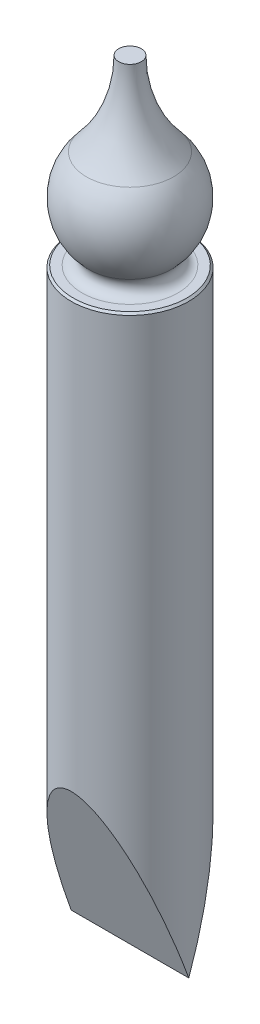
ISO-10303-21;
HEADER;
FILE_DESCRIPTION(('STEP AP214'),'2;1');
FILE_NAME('part.step','',(''),(''),'','','');
FILE_SCHEMA(('AUTOMOTIVE_DESIGN { 1 0 10303 214 1 1 1 1 }'));
ENDSEC;
DATA;
#1=APPLICATION_CONTEXT('core data for automotive mechanical design processes');
#2=APPLICATION_PROTOCOL_DEFINITION('international standard','automotive_design',2000,#1);
#3=PRODUCT_CONTEXT('',#1,'mechanical');
#4=PRODUCT('Part','Part','',(#3));
#5=PRODUCT_RELATED_PRODUCT_CATEGORY('part','',(#4));
#6=PRODUCT_DEFINITION_FORMATION('','',#4);
#7=PRODUCT_DEFINITION_CONTEXT('part definition',#1,'design');
#8=PRODUCT_DEFINITION('design','',#6,#7);
#9=PRODUCT_DEFINITION_SHAPE('','',#8);
#10=(LENGTH_UNIT() NAMED_UNIT(*) SI_UNIT(.MILLI.,.METRE.));
#11=(NAMED_UNIT(*) PLANE_ANGLE_UNIT() SI_UNIT($,.RADIAN.));
#12=(NAMED_UNIT(*) SI_UNIT($,.STERADIAN.) SOLID_ANGLE_UNIT());
#13=UNCERTAINTY_MEASURE_WITH_UNIT(LENGTH_MEASURE(1.E-05),#10,'distance_accuracy_value','');
#14=(GEOMETRIC_REPRESENTATION_CONTEXT(3) GLOBAL_UNCERTAINTY_ASSIGNED_CONTEXT((#13)) GLOBAL_UNIT_ASSIGNED_CONTEXT((#10,
#11,#12)) REPRESENTATION_CONTEXT('',''));
#15=CARTESIAN_POINT('',(0.,0.,0.));
#16=DIRECTION('',(0.,0.,1.));
#17=DIRECTION('',(1.,0.,0.));
#18=AXIS2_PLACEMENT_3D('',#15,#16,#17);
#19=CARTESIAN_POINT('',(-0.575,39.2822667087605,0.));
#20=DIRECTION('',(0.,-1.,0.));
#21=DIRECTION('',(0.,0.,-1.));
#22=AXIS2_PLACEMENT_3D('',#19,#20,#21);
#23=PLANE('',#22);
#24=CARTESIAN_POINT('',(0.,39.2822667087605,0.));
#25=DIRECTION('',(0.,-1.,0.));
#26=DIRECTION('',(0.,0.,-1.));
#27=AXIS2_PLACEMENT_3D('',#24,#25,#26);
#28=CIRCLE('',#27,0.575);
#29=CARTESIAN_POINT('',(0.,39.2822667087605,-0.575));
#30=VERTEX_POINT('',#29);
#31=EDGE_CURVE('E69',#30,#30,#28,.T.);
#32=ORIENTED_EDGE('',*,*,#31,.F.);
#33=EDGE_LOOP('',(#32));
#34=FACE_BOUND('',#33,.T.);
#35=ADVANCED_FACE('F31',(#34),#23,.F.);
#36=CARTESIAN_POINT('',(0.,39.2822667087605,0.));
#37=DIRECTION('',(0.,-1.,0.));
#38=DIRECTION('',(0.,0.,-1.));
#39=AXIS2_PLACEMENT_3D('',#36,#37,#38);
#40=TOROIDAL_SURFACE('',#39,6.925,6.35);
#41=CARTESIAN_POINT('',(0.,35.0157005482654,0.));
#42=DIRECTION('',(0.,-1.,0.));
#43=DIRECTION('',(0.,0.,-1.));
#44=AXIS2_PLACEMENT_3D('',#41,#42,#43);
#45=CIRCLE('',#44,2.22192513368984);
#46=CARTESIAN_POINT('',(-2.22192513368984,35.0157005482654,0.));
#47=VERTEX_POINT('',#46);
#48=EDGE_CURVE('E66',#47,#47,#45,.T.);
#49=ORIENTED_EDGE('',*,*,#48,.F.);
#50=EDGE_LOOP('',(#49));
#51=FACE_BOUND('',#50,.T.);
#52=ORIENTED_EDGE('',*,*,#31,.T.);
#53=EDGE_LOOP('',(#52));
#54=FACE_BOUND('',#53,.T.);
#55=ADVANCED_FACE('F83',(#51,#54),#40,.F.);
#56=CARTESIAN_POINT('',(0.,33.,0.));
#57=DIRECTION('',(0.,-1.,0.));
#58=DIRECTION('',(-1.,0.,0.));
#59=AXIS2_PLACEMENT_3D('',#56,#57,#58);
#60=SPHERICAL_SURFACE('',#59,3.);
#61=CARTESIAN_POINT('',(0.,30.8571428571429,0.));
#62=DIRECTION('',(0.,-1.,0.));
#63=DIRECTION('',(0.,0.,-1.));
#64=AXIS2_PLACEMENT_3D('',#61,#62,#63);
#65=CIRCLE('',#64,2.09956263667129);
#66=CARTESIAN_POINT('',(-2.0995626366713,30.8571428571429,0.));
#67=VERTEX_POINT('',#66);
#68=EDGE_CURVE('E63',#67,#67,#65,.T.);
#69=CARTESIAN_POINT('',(-2.0995626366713,30.8571428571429,0.));
#70=CARTESIAN_POINT('',(-2.1337681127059,30.8906559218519,0.));
#71=CARTESIAN_POINT('',(-2.16716980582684,30.9249892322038,0.));
#72=CARTESIAN_POINT('',(-2.23229208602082,30.9952148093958,0.));
#73=CARTESIAN_POINT('',(-2.26401267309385,31.0311070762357,0.));
#74=CARTESIAN_POINT('',(-2.32569920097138,31.1043690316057,0.));
#75=CARTESIAN_POINT('',(-2.35566514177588,31.1417387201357,0.));
#76=CARTESIAN_POINT('',(-2.41377389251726,31.2178696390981,0.));
#77=CARTESIAN_POINT('',(-2.44191670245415,31.2566308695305,0.));
#78=CARTESIAN_POINT('',(-2.49631461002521,31.3354560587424,0.));
#79=CARTESIAN_POINT('',(-2.52256970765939,31.3755200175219,0.));
#80=CARTESIAN_POINT('',(-2.57313201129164,31.4568587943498,0.));
#81=CARTESIAN_POINT('',(-2.5974392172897,31.4981336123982,0.));
#82=CARTESIAN_POINT('',(-2.64405000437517,31.581799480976,0.));
#83=CARTESIAN_POINT('',(-2.66635358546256,31.6241905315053,0.));
#84=CARTESIAN_POINT('',(-2.70890598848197,31.7099916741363,0.));
#85=CARTESIAN_POINT('',(-2.72915481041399,31.753401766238,0.));
#86=CARTESIAN_POINT('',(-2.76755127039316,31.8411414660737,0.));
#87=CARTESIAN_POINT('',(-2.78569890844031,31.8854710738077,0.));
#88=CARTESIAN_POINT('',(-2.81985139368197,31.9749481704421,0.));
#89=CARTESIAN_POINT('',(-2.83585624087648,32.0200956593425,0.));
#90=CARTESIAN_POINT('',(-2.86568645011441,32.1111050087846,0.));
#91=CARTESIAN_POINT('',(-2.87951181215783,32.1569668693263,0.));
#92=CARTESIAN_POINT('',(-2.90495135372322,32.2492998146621,0.));
#93=CARTESIAN_POINT('',(-2.9165655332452,32.2957708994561,0.));
#94=CARTESIAN_POINT('',(-2.93755608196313,32.3892157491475,0.));
#95=CARTESIAN_POINT('',(-2.94693245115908,32.4361895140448,0.));
#96=CARTESIAN_POINT('',(-2.96342588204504,32.5305320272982,0.));
#97=CARTESIAN_POINT('',(-2.97054294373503,32.5779007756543,0.));
#98=CARTESIAN_POINT('',(-2.98250144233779,32.6729246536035,0.));
#99=CARTESIAN_POINT('',(-2.98734287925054,32.7205797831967,0.));
#100=CARTESIAN_POINT('',(-2.99473902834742,32.8160671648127,0.));
#101=CARTESIAN_POINT('',(-2.99729374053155,32.8638994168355,0.));
#102=CARTESIAN_POINT('',(-3.00011058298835,32.9596313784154,0.));
#103=CARTESIAN_POINT('',(-3.00037271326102,33.0075310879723,0.));
#104=CARTESIAN_POINT('',(-2.99860379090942,33.1032881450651,0.));
#105=CARTESIAN_POINT('',(-2.99657273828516,33.1511454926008,0.));
#106=CARTESIAN_POINT('',(-2.99022210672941,33.2467081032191,0.));
#107=CARTESIAN_POINT('',(-2.98590252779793,33.2944133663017,0.));
#108=CARTESIAN_POINT('',(-2.97498474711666,33.3895624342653,0.));
#109=CARTESIAN_POINT('',(-2.96838654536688,33.4370062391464,0.));
#110=CARTESIAN_POINT('',(-2.95292664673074,33.5315236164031,0.));
#111=CARTESIAN_POINT('',(-2.94406494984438,33.5785971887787,0.));
#112=CARTESIAN_POINT('',(-2.92409837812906,33.6722661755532,0.));
#113=CARTESIAN_POINT('',(-2.91299350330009,33.7188615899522,0.));
#114=CARTESIAN_POINT('',(-2.88856603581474,33.8114674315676,0.));
#115=CARTESIAN_POINT('',(-2.87524344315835,33.8574778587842,0.));
#116=CARTESIAN_POINT('',(-2.84641108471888,33.9488082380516,0.));
#117=CARTESIAN_POINT('',(-2.83090131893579,33.9941281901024,0.));
#118=CARTESIAN_POINT('',(-2.79773017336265,34.0839737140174,0.));
#119=CARTESIAN_POINT('',(-2.7800687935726,34.1284992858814,0.));
#120=CARTESIAN_POINT('',(-2.74263491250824,34.2166539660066,0.));
#121=CARTESIAN_POINT('',(-2.72286241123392,34.2602830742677,0.));
#122=CARTESIAN_POINT('',(-2.68125161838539,34.3465447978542,0.));
#123=CARTESIAN_POINT('',(-2.65941332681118,34.3891774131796,0.));
#124=CARTESIAN_POINT('',(-2.61372102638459,34.4733484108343,0.));
#125=CARTESIAN_POINT('',(-2.58986701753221,34.5148867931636,0.));
#126=CARTESIAN_POINT('',(-2.54019795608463,34.5967740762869,0.));
#127=CARTESIAN_POINT('',(-2.51438290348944,34.6371229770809,0.));
#128=CARTESIAN_POINT('',(-2.46085100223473,34.7165388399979,0.));
#129=CARTESIAN_POINT('',(-2.43313415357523,34.7556058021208,0.));
#130=CARTESIAN_POINT('',(-2.37586197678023,34.8323680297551,0.));
#131=CARTESIAN_POINT('',(-2.34630664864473,34.8700632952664,0.));
#132=CARTESIAN_POINT('',(-2.28542613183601,34.9439964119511,0.));
#133=CARTESIAN_POINT('',(-2.25410094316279,34.9802342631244,0.));
#134=CARTESIAN_POINT('',(-2.22192513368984,35.0157005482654,0.));
#135=B_SPLINE_CURVE_WITH_KNOTS('',3,(#69,#70,#71,#72,#73,#74,#75,#76,#77,#78,#79,#80,#81,#82,
#83,#84,#85,#86,#87,#88,#89,#90,#91,#92,#93,#94,#95,#96,#97,#98,#99,#100,#101,#102,#103,#104,
#105,#106,#107,#108,#109,#110,#111,#112,#113,#114,#115,#116,#117,#118,#119,#120,#121,#122,#123,
#124,#125,#126,#127,#128,#129,#130,#131,#132,#133,#134),.UNSPECIFIED.,.F.,.F.,(4,2,2,2,2,2,2,2,
2,2,2,2,2,2,2,2,2,2,2,2,2,2,2,2,2,2,2,2,2,2,2,2,4),(0.,0.143646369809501,0.287292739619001,
0.430939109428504,0.574585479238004,0.718231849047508,0.86187821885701,1.00552458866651,
1.14917095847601,1.29281732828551,1.43646369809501,1.58011006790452,1.72375643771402,
1.86740280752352,2.01104917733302,2.15469554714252,2.29834191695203,2.44198828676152,
2.58563465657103,2.72928102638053,2.87292739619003,3.01657376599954,3.16022013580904,
3.30386650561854,3.44751287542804,3.59115924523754,3.73480561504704,3.87845198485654,
4.02209835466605,4.16574472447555,4.30939109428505,4.45303746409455,4.59668383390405),.UNSPECIFIED.);
#136=EDGE_CURVE('BSEAM88',#67,#47,#135,.T.);
#137=ORIENTED_EDGE('',*,*,#68,.F.);
#138=ORIENTED_EDGE('',*,*,#48,.T.);
#139=ORIENTED_EDGE('',*,*,#136,.T.);
#140=ORIENTED_EDGE('',*,*,#136,.F.);
#141=EDGE_LOOP('',(#137,#139,#138,#140));
#142=FACE_BOUND('',#141,.T.);
#143=ADVANCED_FACE('F88',(#142),#60,.T.);
#144=CARTESIAN_POINT('',(0.,30.5,0.));
#145=DIRECTION('',(0.,-1.,0.));
#146=DIRECTION('',(0.,0.,-1.));
#147=AXIS2_PLACEMENT_3D('',#144,#145,#146);
#148=TOROIDAL_SURFACE('',#147,2.44948974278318,0.500000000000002);
#149=CARTESIAN_POINT('',(0.,30.,0.));
#150=DIRECTION('',(0.,-1.,0.));
#151=DIRECTION('',(0.,0.,-1.));
#152=AXIS2_PLACEMENT_3D('',#149,#150,#151);
#153=CIRCLE('',#152,2.44948974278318);
#154=CARTESIAN_POINT('',(0.,30.,-2.44948974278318));
#155=VERTEX_POINT('',#154);
#156=EDGE_CURVE('E52',#155,#155,#153,.T.);
#157=ORIENTED_EDGE('',*,*,#156,.F.);
#158=EDGE_LOOP('',(#157));
#159=FACE_BOUND('',#158,.T.);
#160=ORIENTED_EDGE('',*,*,#68,.T.);
#161=EDGE_LOOP('',(#160));
#162=FACE_BOUND('',#161,.T.);
#163=ADVANCED_FACE('F95',(#159,#162),#148,.F.);
#164=CARTESIAN_POINT('',(-3.,30.,0.));
#165=DIRECTION('',(0.,-1.,0.));
#166=DIRECTION('',(0.,0.,-1.));
#167=AXIS2_PLACEMENT_3D('',#164,#165,#166);
#168=PLANE('',#167);
#169=CARTESIAN_POINT('',(0.,30.,0.));
#170=DIRECTION('',(0.,-1.,0.));
#171=DIRECTION('',(0.,0.,-1.));
#172=AXIS2_PLACEMENT_3D('',#169,#170,#171);
#173=CIRCLE('',#172,2.89999999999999);
#174=CARTESIAN_POINT('',(0.,30.,-2.89999999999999));
#175=VERTEX_POINT('',#174);
#176=EDGE_CURVE('E11',#175,#175,#173,.F.);
#177=ORIENTED_EDGE('',*,*,#176,.T.);
#178=EDGE_LOOP('',(#177));
#179=FACE_BOUND('',#178,.T.);
#180=ORIENTED_EDGE('',*,*,#156,.T.);
#181=EDGE_LOOP('',(#180));
#182=FACE_BOUND('',#181,.T.);
#183=ADVANCED_FACE('F99',(#179,#182),#168,.F.);
#184=CARTESIAN_POINT('',(0.,0.,0.));
#185=DIRECTION('',(0.,-1.,0.));
#186=DIRECTION('',(0.,0.,-1.));
#187=AXIS2_PLACEMENT_3D('',#184,#185,#186);
#188=CYLINDRICAL_SURFACE('',#187,3.);
#189=CARTESIAN_POINT('',(0.,29.9,0.));
#190=DIRECTION('',(0.,-1.,0.));
#191=DIRECTION('',(0.,0.,-1.));
#192=AXIS2_PLACEMENT_3D('',#189,#190,#191);
#193=CIRCLE('',#192,3.);
#194=CARTESIAN_POINT('',(0.,29.9,-3.));
#195=VERTEX_POINT('',#194);
#196=EDGE_CURVE('E39',#195,#195,#193,.T.);
#197=ORIENTED_EDGE('',*,*,#196,.T.);
#198=EDGE_LOOP('',(#197));
#199=FACE_BOUND('',#198,.T.);
#200=CARTESIAN_POINT('',(0.,0.,0.));
#201=DIRECTION('',(0.,0.34202014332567,-0.939692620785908));
#202=DIRECTION('',(0.,-0.939692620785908,-0.34202014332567));
#203=AXIS2_PLACEMENT_3D('',#200,#201,#202);
#204=ELLIPSE('',#203,8.77141320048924,3.);
#205=CARTESIAN_POINT('',(-3.,0.,0.));
#206=VERTEX_POINT('',#205);
#207=CARTESIAN_POINT('',(3.,0.,0.));
#208=VERTEX_POINT('',#207);
#209=EDGE_CURVE('E45',#206,#208,#204,.T.);
#210=ORIENTED_EDGE('',*,*,#209,.T.);
#211=CARTESIAN_POINT('',(0.,0.,0.));
#212=DIRECTION('',(0.,0.34202014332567,0.939692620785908));
#213=DIRECTION('',(0.,-0.939692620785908,0.34202014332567));
#214=AXIS2_PLACEMENT_3D('',#211,#212,#213);
#215=ELLIPSE('',#214,8.77141320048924,3.);
#216=EDGE_CURVE('E48',#208,#206,#215,.T.);
#217=ORIENTED_EDGE('',*,*,#216,.T.);
#218=EDGE_LOOP('',(#210,#217));
#219=FACE_BOUND('',#218,.T.);
#220=ADVANCED_FACE('F49',(#199,#219),#188,.T.);
#221=CARTESIAN_POINT('',(-5.,0.,0.));
#222=DIRECTION('',(0.,0.34202014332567,0.939692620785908));
#223=DIRECTION('',(0.,-0.939692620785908,0.34202014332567));
#224=AXIS2_PLACEMENT_3D('',#221,#222,#223);
#225=PLANE('',#224);
#226=DIRECTION('',(1.,0.,0.));
#227=VECTOR('',#226,1.);
#228=CARTESIAN_POINT('',(-5.,0.,0.));
#229=LINE('',#228,#227);
#230=EDGE_CURVE('E56',#206,#208,#229,.T.);
#231=ORIENTED_EDGE('',*,*,#230,.F.);
#232=ORIENTED_EDGE('',*,*,#216,.F.);
#233=EDGE_LOOP('',(#231,#232));
#234=FACE_BOUND('',#233,.T.);
#235=ADVANCED_FACE('F58',(#234),#225,.F.);
#236=CARTESIAN_POINT('',(-5.,0.,0.));
#237=DIRECTION('',(0.,0.34202014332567,-0.939692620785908));
#238=DIRECTION('',(0.,0.939692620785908,0.34202014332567));
#239=AXIS2_PLACEMENT_3D('',#236,#237,#238);
#240=PLANE('',#239);
#241=ORIENTED_EDGE('',*,*,#230,.T.);
#242=ORIENTED_EDGE('',*,*,#209,.F.);
#243=EDGE_LOOP('',(#241,#242));
#244=FACE_BOUND('',#243,.T.);
#245=ADVANCED_FACE('F55',(#244),#240,.F.);
#246=CARTESIAN_POINT('',(0.,29.9,0.));
#247=DIRECTION('',(0.,-1.,0.));
#248=DIRECTION('',(0.,0.,-1.));
#249=AXIS2_PLACEMENT_3D('',#246,#247,#248);
#250=CONICAL_SURFACE('',#249,3.,0.78539816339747);
#251=ORIENTED_EDGE('',*,*,#176,.F.);
#252=EDGE_LOOP('',(#251));
#253=FACE_BOUND('',#252,.T.);
#254=ORIENTED_EDGE('',*,*,#196,.F.);
#255=EDGE_LOOP('',(#254));
#256=FACE_BOUND('',#255,.T.);
#257=ADVANCED_FACE('F33',(#253,#256),#250,.T.);
#258=CLOSED_SHELL('',(#35,#55,#143,#163,#183,#220,#235,#245,#257));
#259=MANIFOLD_SOLID_BREP('B2',#258);
#260=ADVANCED_BREP_SHAPE_REPRESENTATION('',(#18,#259),#14);
#261=SHAPE_DEFINITION_REPRESENTATION(#9,#260);
ENDSEC;
END-ISO-10303-21;
